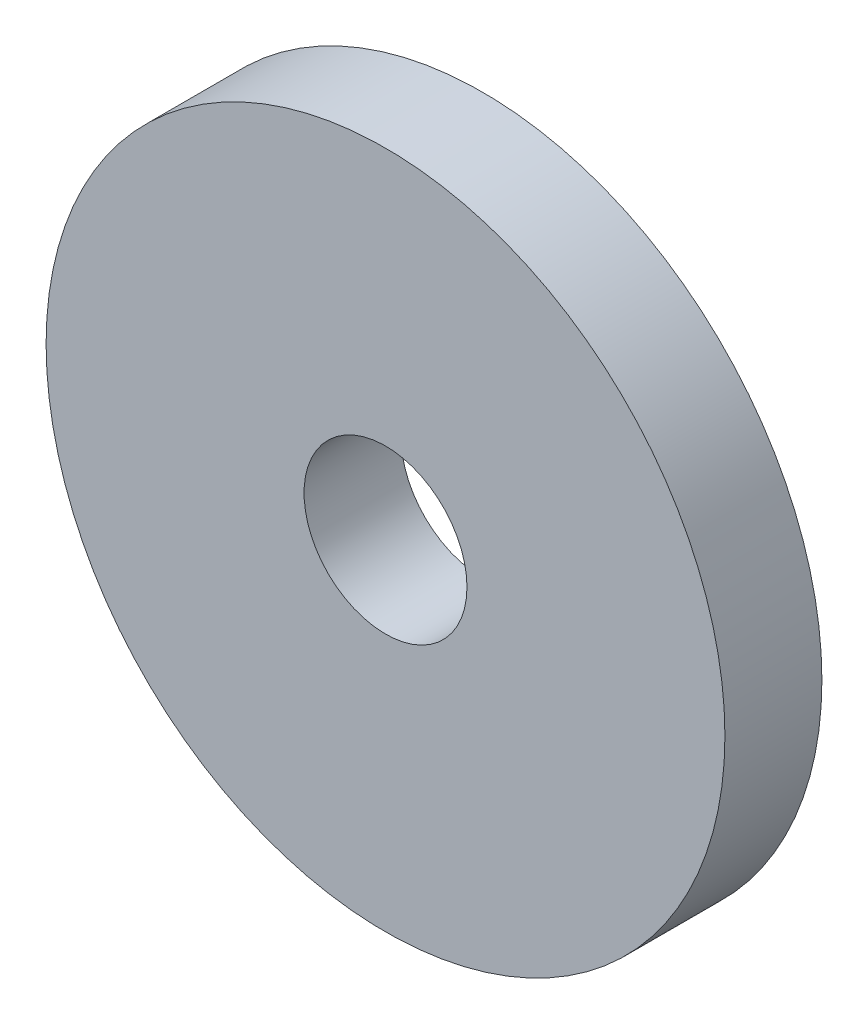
ISO-10303-21;
HEADER;
FILE_DESCRIPTION(('STEP AP214'),'2;1');
FILE_NAME('part.step','',(''),(''),'','','');
FILE_SCHEMA(('AUTOMOTIVE_DESIGN { 1 0 10303 214 1 1 1 1 }'));
ENDSEC;
DATA;
#1=APPLICATION_CONTEXT('core data for automotive mechanical design processes');
#2=APPLICATION_PROTOCOL_DEFINITION('international standard','automotive_design',2000,#1);
#3=PRODUCT_CONTEXT('',#1,'mechanical');
#4=PRODUCT('Part','Part','',(#3));
#5=PRODUCT_RELATED_PRODUCT_CATEGORY('part','',(#4));
#6=PRODUCT_DEFINITION_FORMATION('','',#4);
#7=PRODUCT_DEFINITION_CONTEXT('part definition',#1,'design');
#8=PRODUCT_DEFINITION('design','',#6,#7);
#9=PRODUCT_DEFINITION_SHAPE('','',#8);
#10=(LENGTH_UNIT() NAMED_UNIT(*) SI_UNIT(.MILLI.,.METRE.));
#11=(NAMED_UNIT(*) PLANE_ANGLE_UNIT() SI_UNIT($,.RADIAN.));
#12=(NAMED_UNIT(*) SI_UNIT($,.STERADIAN.) SOLID_ANGLE_UNIT());
#13=UNCERTAINTY_MEASURE_WITH_UNIT(LENGTH_MEASURE(1.E-05),#10,'distance_accuracy_value','');
#14=(GEOMETRIC_REPRESENTATION_CONTEXT(3) GLOBAL_UNCERTAINTY_ASSIGNED_CONTEXT((#13)) GLOBAL_UNIT_ASSIGNED_CONTEXT((#10,
#11,#12)) REPRESENTATION_CONTEXT('',''));
#15=CARTESIAN_POINT('',(0.,0.,0.));
#16=DIRECTION('',(0.,0.,1.));
#17=DIRECTION('',(1.,0.,0.));
#18=AXIS2_PLACEMENT_3D('',#15,#16,#17);
#19=CARTESIAN_POINT('',(0.,0.,5.));
#20=DIRECTION('',(0.,0.,1.));
#21=DIRECTION('',(1.,0.,0.));
#22=AXIS2_PLACEMENT_3D('',#19,#20,#21);
#23=PLANE('',#22);
#24=CARTESIAN_POINT('',(0.,0.,5.));
#25=DIRECTION('',(0.,0.,1.));
#26=DIRECTION('',(1.,0.,0.));
#27=AXIS2_PLACEMENT_3D('',#24,#25,#26);
#28=CIRCLE('',#27,17.5);
#29=CARTESIAN_POINT('',(17.5,0.,5.));
#30=VERTEX_POINT('',#29);
#31=EDGE_CURVE('E8',#30,#30,#28,.T.);
#32=ORIENTED_EDGE('',*,*,#31,.T.);
#33=EDGE_LOOP('',(#32));
#34=FACE_BOUND('',#33,.T.);
#35=CARTESIAN_POINT('',(0.,0.,5.));
#36=DIRECTION('',(0.,0.,1.));
#37=DIRECTION('',(1.,0.,0.));
#38=AXIS2_PLACEMENT_3D('',#35,#36,#37);
#39=CIRCLE('',#38,4.2);
#40=CARTESIAN_POINT('',(4.2,0.,5.));
#41=VERTEX_POINT('',#40);
#42=EDGE_CURVE('E23',#41,#41,#39,.T.);
#43=ORIENTED_EDGE('',*,*,#42,.F.);
#44=EDGE_LOOP('',(#43));
#45=FACE_BOUND('',#44,.T.);
#46=ADVANCED_FACE('F12',(#34,#45),#23,.T.);
#47=CARTESIAN_POINT('',(0.,0.,0.));
#48=DIRECTION('',(0.,0.,1.));
#49=DIRECTION('',(1.,0.,0.));
#50=AXIS2_PLACEMENT_3D('',#47,#48,#49);
#51=PLANE('',#50);
#52=CARTESIAN_POINT('',(0.,0.,0.));
#53=DIRECTION('',(0.,0.,1.));
#54=DIRECTION('',(1.,0.,0.));
#55=AXIS2_PLACEMENT_3D('',#52,#53,#54);
#56=CIRCLE('',#55,17.5);
#57=CARTESIAN_POINT('',(17.5,0.,0.));
#58=VERTEX_POINT('',#57);
#59=EDGE_CURVE('E19',#58,#58,#56,.T.);
#60=ORIENTED_EDGE('',*,*,#59,.F.);
#61=EDGE_LOOP('',(#60));
#62=FACE_BOUND('',#61,.T.);
#63=CARTESIAN_POINT('',(0.,0.,0.));
#64=DIRECTION('',(0.,0.,1.));
#65=DIRECTION('',(1.,0.,0.));
#66=AXIS2_PLACEMENT_3D('',#63,#64,#65);
#67=CIRCLE('',#66,4.2);
#68=CARTESIAN_POINT('',(4.2,0.,0.));
#69=VERTEX_POINT('',#68);
#70=EDGE_CURVE('E27',#69,#69,#67,.T.);
#71=ORIENTED_EDGE('',*,*,#70,.T.);
#72=EDGE_LOOP('',(#71));
#73=FACE_BOUND('',#72,.T.);
#74=ADVANCED_FACE('F33',(#62,#73),#51,.F.);
#75=CARTESIAN_POINT('',(0.,0.,5.));
#76=DIRECTION('',(0.,0.,-1.));
#77=DIRECTION('',(-1.,0.,0.));
#78=AXIS2_PLACEMENT_3D('',#75,#76,#77);
#79=CYLINDRICAL_SURFACE('',#78,17.5);
#80=ORIENTED_EDGE('',*,*,#31,.F.);
#81=EDGE_LOOP('',(#80));
#82=FACE_BOUND('',#81,.T.);
#83=ORIENTED_EDGE('',*,*,#59,.T.);
#84=EDGE_LOOP('',(#83));
#85=FACE_BOUND('',#84,.T.);
#86=ADVANCED_FACE('F14',(#82,#85),#79,.T.);
#87=CARTESIAN_POINT('',(0.,0.,5.));
#88=DIRECTION('',(0.,0.,-1.));
#89=DIRECTION('',(-1.,0.,0.));
#90=AXIS2_PLACEMENT_3D('',#87,#88,#89);
#91=CYLINDRICAL_SURFACE('',#90,4.2);
#92=ORIENTED_EDGE('',*,*,#42,.T.);
#93=EDGE_LOOP('',(#92));
#94=FACE_BOUND('',#93,.T.);
#95=ORIENTED_EDGE('',*,*,#70,.F.);
#96=EDGE_LOOP('',(#95));
#97=FACE_BOUND('',#96,.T.);
#98=ADVANCED_FACE('F35',(#94,#97),#91,.F.);
#99=CLOSED_SHELL('',(#46,#74,#86,#98));
#100=MANIFOLD_SOLID_BREP('B1',#99);
#101=ADVANCED_BREP_SHAPE_REPRESENTATION('',(#18,#100),#14);
#102=SHAPE_DEFINITION_REPRESENTATION(#9,#101);
ENDSEC;
END-ISO-10303-21;
